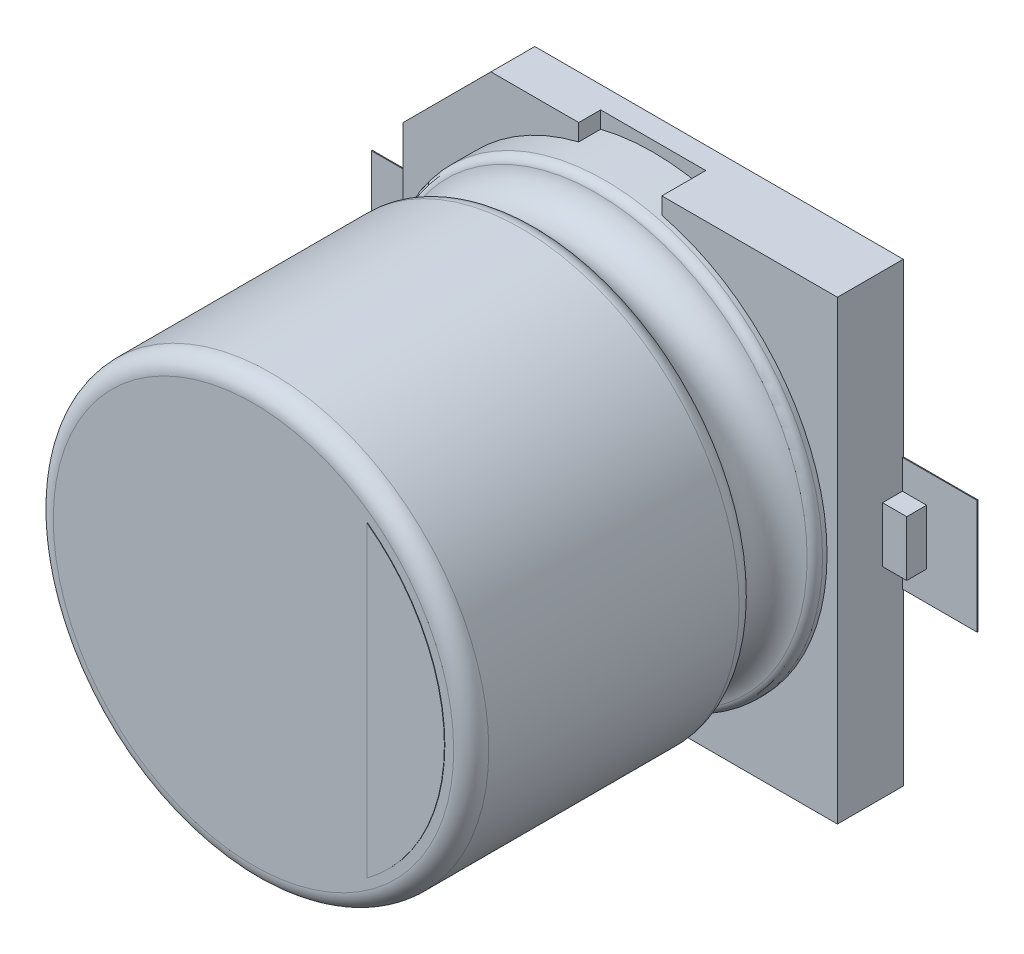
ISO-10303-21;
HEADER;
FILE_DESCRIPTION(('STEP AP214'),'2;1');
FILE_NAME('part.step','',(''),(''),'','','');
FILE_SCHEMA(('AUTOMOTIVE_DESIGN { 1 0 10303 214 1 1 1 1 }'));
ENDSEC;
DATA;
#1=APPLICATION_CONTEXT('core data for automotive mechanical design processes');
#2=APPLICATION_PROTOCOL_DEFINITION('international standard','automotive_design',2000,#1);
#3=PRODUCT_CONTEXT('',#1,'mechanical');
#4=PRODUCT('Part','Part','',(#3));
#5=PRODUCT_RELATED_PRODUCT_CATEGORY('part','',(#4));
#6=PRODUCT_DEFINITION_FORMATION('','',#4);
#7=PRODUCT_DEFINITION_CONTEXT('part definition',#1,'design');
#8=PRODUCT_DEFINITION('design','',#6,#7);
#9=PRODUCT_DEFINITION_SHAPE('','',#8);
#10=(LENGTH_UNIT() NAMED_UNIT(*) SI_UNIT(.MILLI.,.METRE.));
#11=(NAMED_UNIT(*) PLANE_ANGLE_UNIT() SI_UNIT($,.RADIAN.));
#12=(NAMED_UNIT(*) SI_UNIT($,.STERADIAN.) SOLID_ANGLE_UNIT());
#13=UNCERTAINTY_MEASURE_WITH_UNIT(LENGTH_MEASURE(1.E-05),#10,'distance_accuracy_value','');
#14=(GEOMETRIC_REPRESENTATION_CONTEXT(3) GLOBAL_UNCERTAINTY_ASSIGNED_CONTEXT((#13)) GLOBAL_UNIT_ASSIGNED_CONTEXT((#10,
#11,#12)) REPRESENTATION_CONTEXT('',''));
#15=CARTESIAN_POINT('',(0.,0.,0.));
#16=DIRECTION('',(0.,0.,1.));
#17=DIRECTION('',(1.,0.,0.));
#18=AXIS2_PLACEMENT_3D('',#15,#16,#17);
#19=CARTESIAN_POINT('',(0.,0.,6.182614));
#20=DIRECTION('',(0.,0.,1.));
#21=DIRECTION('',(1.,0.,0.));
#22=AXIS2_PLACEMENT_3D('',#19,#20,#21);
#23=PLANE('',#22);
#24=CARTESIAN_POINT('',(0.,0.,6.182614));
#25=DIRECTION('',(0.,0.,1.));
#26=DIRECTION('',(1.,0.,0.));
#27=AXIS2_PLACEMENT_3D('',#24,#25,#26);
#28=CIRCLE('',#27,2.7686291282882);
#29=CARTESIAN_POINT('',(1.651,2.22250000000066,6.182614));
#30=VERTEX_POINT('',#29);
#31=CARTESIAN_POINT('',(1.651,-2.22250000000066,6.182614));
#32=VERTEX_POINT('',#31);
#33=EDGE_CURVE('E235',#30,#32,#28,.F.);
#34=ORIENTED_EDGE('',*,*,#33,.F.);
#35=DIRECTION('',(0.,1.,0.));
#36=VECTOR('',#35,1.);
#37=CARTESIAN_POINT('',(1.651,2.2225,6.182614));
#38=LINE('',#37,#36);
#39=EDGE_CURVE('E229',#32,#30,#38,.T.);
#40=ORIENTED_EDGE('',*,*,#39,.F.);
#41=EDGE_LOOP('',(#34,#40));
#42=FACE_BOUND('',#41,.T.);
#43=ADVANCED_FACE('F16',(#42),#23,.T.);
#44=CARTESIAN_POINT('',(0.,0.,6.176264));
#45=DIRECTION('',(0.,0.,1.));
#46=DIRECTION('',(1.,0.,0.));
#47=AXIS2_PLACEMENT_3D('',#44,#45,#46);
#48=CYLINDRICAL_SURFACE('',#47,2.7686291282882);
#49=DIRECTION('',(0.,0.,1.));
#50=VECTOR('',#49,1.);
#51=CARTESIAN_POINT('',(1.651,-2.2225,6.176264));
#52=LINE('',#51,#50);
#53=CARTESIAN_POINT('',(1.651,-2.22250000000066,6.176264));
#54=VERTEX_POINT('',#53);
#55=EDGE_CURVE('E238',#54,#32,#52,.T.);
#56=ORIENTED_EDGE('',*,*,#55,.F.);
#57=CARTESIAN_POINT('',(0.,0.,6.176264));
#58=DIRECTION('',(0.,0.,1.));
#59=DIRECTION('',(1.,0.,0.));
#60=AXIS2_PLACEMENT_3D('',#57,#58,#59);
#61=CIRCLE('',#60,2.7686291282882);
#62=CARTESIAN_POINT('',(1.651,2.22250000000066,6.176264));
#63=VERTEX_POINT('',#62);
#64=EDGE_CURVE('E248',#63,#54,#61,.F.);
#65=ORIENTED_EDGE('',*,*,#64,.F.);
#66=DIRECTION('',(0.,0.,1.));
#67=VECTOR('',#66,1.);
#68=CARTESIAN_POINT('',(1.651,2.2225,6.176264));
#69=LINE('',#68,#67);
#70=EDGE_CURVE('E240',#30,#63,#69,.F.);
#71=ORIENTED_EDGE('',*,*,#70,.F.);
#72=ORIENTED_EDGE('',*,*,#33,.T.);
#73=EDGE_LOOP('',(#56,#65,#71,#72));
#74=FACE_BOUND('',#73,.T.);
#75=ADVANCED_FACE('F236',(#74),#48,.T.);
#76=CARTESIAN_POINT('',(1.651,2.2225,6.176264));
#77=DIRECTION('',(-1.,0.,0.));
#78=DIRECTION('',(0.,0.,1.));
#79=AXIS2_PLACEMENT_3D('',#76,#77,#78);
#80=PLANE('',#79);
#81=ORIENTED_EDGE('',*,*,#70,.T.);
#82=DIRECTION('',(0.,1.,0.));
#83=VECTOR('',#82,1.);
#84=CARTESIAN_POINT('',(1.651,0.,6.176264));
#85=LINE('',#84,#83);
#86=EDGE_CURVE('E245',#54,#63,#85,.T.);
#87=ORIENTED_EDGE('',*,*,#86,.F.);
#88=ORIENTED_EDGE('',*,*,#55,.T.);
#89=ORIENTED_EDGE('',*,*,#39,.T.);
#90=EDGE_LOOP('',(#81,#87,#88,#89));
#91=FACE_BOUND('',#90,.T.);
#92=ADVANCED_FACE('F243',(#91),#80,.T.);
#93=CARTESIAN_POINT('',(0.,0.,6.176264));
#94=DIRECTION('',(0.,0.,1.));
#95=DIRECTION('',(1.,0.,0.));
#96=AXIS2_PLACEMENT_3D('',#93,#94,#95);
#97=PLANE('',#96);
#98=ORIENTED_EDGE('',*,*,#64,.T.);
#99=ORIENTED_EDGE('',*,*,#86,.T.);
#100=EDGE_LOOP('',(#98,#99));
#101=FACE_BOUND('',#100,.T.);
#102=CARTESIAN_POINT('',(2.89599998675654,0.,6.176264));
#103=CARTESIAN_POINT('',(2.89600001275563,-0.00295847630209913,6.17626399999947));
#104=CARTESIAN_POINT('',(2.89599562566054,-0.00591696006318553,6.17626400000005));
#105=CARTESIAN_POINT('',(2.89598243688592,-0.0103730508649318,6.17626399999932));
#106=CARTESIAN_POINT('',(2.89597688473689,-0.0118706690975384,6.1762639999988));
#107=CARTESIAN_POINT('',(2.89596349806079,-0.0148781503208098,6.17626399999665));
#108=CARTESIAN_POINT('',(2.89595564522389,-0.0163880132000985,6.17626399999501));
#109=CARTESIAN_POINT('',(2.89566773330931,-0.0645122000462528,6.17626399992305));
#110=CARTESIAN_POINT('',(2.89426393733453,-0.111127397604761,6.17626399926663));
#111=CARTESIAN_POINT('',(2.88920686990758,-0.204232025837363,6.17626399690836));
#112=CARTESIAN_POINT('',(2.88555357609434,-0.250721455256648,6.17626399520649));
#113=CARTESIAN_POINT('',(2.87600677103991,-0.343471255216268,6.17626399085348));
#114=CARTESIAN_POINT('',(2.87011323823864,-0.389731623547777,6.17626398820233));
#115=CARTESIAN_POINT('',(2.85609945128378,-0.481914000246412,6.17626398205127));
#116=CARTESIAN_POINT('',(2.84797917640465,-0.527836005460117,6.17626397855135));
#117=CARTESIAN_POINT('',(2.82953086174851,-0.619234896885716,6.17626397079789));
#118=CARTESIAN_POINT('',(2.81920280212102,-0.664711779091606,6.17626396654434));
#119=CARTESIAN_POINT('',(2.79636295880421,-0.755114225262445,6.17626395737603));
#120=CARTESIAN_POINT('',(2.78385115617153,-0.800039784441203,6.17626395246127));
#121=CARTESIAN_POINT('',(2.75667296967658,-0.889234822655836,6.17626394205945));
#122=CARTESIAN_POINT('',(2.74200656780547,-0.933504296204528,6.17626393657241));
#123=CARTESIAN_POINT('',(2.71055339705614,-1.0212837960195,6.17626392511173));
#124=CARTESIAN_POINT('',(2.69376661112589,-1.06479381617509,6.1762639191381));
#125=CARTESIAN_POINT('',(2.65781749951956,-1.15166401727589,6.17626390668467));
#126=CARTESIAN_POINT('',(2.63862053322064,-1.1950098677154,6.17626390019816));
#127=CARTESIAN_POINT('',(2.59812231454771,-1.28070745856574,6.17626388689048));
#128=CARTESIAN_POINT('',(2.57682104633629,-1.32305919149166,6.17626388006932));
#129=CARTESIAN_POINT('',(2.53216550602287,-1.40666653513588,6.17626386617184));
#130=CARTESIAN_POINT('',(2.50881121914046,-1.44792213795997,6.17626385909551));
#131=CARTESIAN_POINT('',(2.46010591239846,-1.52923774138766,6.17626384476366));
#132=CARTESIAN_POINT('',(2.43475487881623,-1.56929773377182,6.17626383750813));
#133=CARTESIAN_POINT('',(2.38211715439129,-1.6481255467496,6.1762638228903));
#134=CARTESIAN_POINT('',(2.35483045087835,-1.6868933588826,6.176263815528));
#135=CARTESIAN_POINT('',(2.29838713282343,-1.76304334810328,6.17626380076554));
#136=CARTESIAN_POINT('',(2.2692305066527,-1.80042551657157,6.17626379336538));
#137=CARTESIAN_POINT('',(2.20911759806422,-1.87371409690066,6.17626377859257));
#138=CARTESIAN_POINT('',(2.17816130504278,-1.90962050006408,6.17626377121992));
#139=CARTESIAN_POINT('',(2.11452365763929,-1.97987098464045,6.17626375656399));
#140=CARTESIAN_POINT('',(2.08184229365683,-2.0142150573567,6.17626374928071));
#141=CARTESIAN_POINT('',(2.01483325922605,-2.08125808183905,6.17626373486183));
#142=CARTESIAN_POINT('',(1.98050558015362,-2.11395702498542,6.17626372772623));
#143=CARTESIAN_POINT('',(1.91028664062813,-2.17763095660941,6.17626371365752));
#144=CARTESIAN_POINT('',(1.87439537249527,-2.20860593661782,6.17626370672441));
#145=CARTESIAN_POINT('',(1.80113575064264,-2.26875726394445,6.17626369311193));
#146=CARTESIAN_POINT('',(1.76376739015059,-2.29793360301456,6.17626368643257));
#147=CARTESIAN_POINT('',(1.68764364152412,-2.35441730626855,6.17626367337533));
#148=CARTESIAN_POINT('',(1.64888824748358,-2.38172466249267,6.17626366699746));
#149=CARTESIAN_POINT('',(1.57008383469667,-2.43440456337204,6.17626365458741));
#150=CARTESIAN_POINT('',(1.5300348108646,-2.45977710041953,6.17626364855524));
#151=CARTESIAN_POINT('',(1.44873966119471,-2.50852619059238,6.17626363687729));
#152=CARTESIAN_POINT('',(1.40749353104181,-2.5319027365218,6.1762636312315));
#153=CARTESIAN_POINT('',(1.32390357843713,-2.57660348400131,6.17626362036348));
#154=CARTESIAN_POINT('',(1.28155975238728,-2.59792767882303,6.17626361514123));
#155=CARTESIAN_POINT('',(1.19587646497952,-2.63847231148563,6.17626360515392));
#156=CARTESIAN_POINT('',(1.15253700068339,-2.65769274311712,6.17626360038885));
#157=CARTESIAN_POINT('',(1.06496689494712,-2.69398350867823,6.17626359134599));
#158=CARTESIAN_POINT('',(1.02073625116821,-2.71105383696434,6.17626358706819));
#159=CARTESIAN_POINT('',(0.931490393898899,-2.74300323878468,6.17626357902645));
#160=CARTESIAN_POINT('',(0.886475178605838,-2.75788230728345,6.1762635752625));
#161=CARTESIAN_POINT('',(0.795768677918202,-2.78541331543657,6.1762635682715));
#162=CARTESIAN_POINT('',(0.750077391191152,-2.79806525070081,6.17626356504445));
#163=CARTESIAN_POINT('',(0.658128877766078,-2.82111148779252,6.17626355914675));
#164=CARTESIAN_POINT('',(0.611871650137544,-2.83150578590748,6.17626355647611));
#165=CARTESIAN_POINT('',(0.518902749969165,-2.85001168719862,6.17626355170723));
#166=CARTESIAN_POINT('',(0.472191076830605,-2.85812328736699,6.176263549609));
#167=CARTESIAN_POINT('',(0.37842587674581,-2.87204423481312,6.17626354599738));
#168=CARTESIAN_POINT('',(0.331372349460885,-2.87785357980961,6.17626354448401));
#169=CARTESIAN_POINT('',(0.237036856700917,-2.88715600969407,6.17626354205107));
#170=CARTESIAN_POINT('',(0.189754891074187,-2.89064909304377,6.1762635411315));
#171=CARTESIAN_POINT('',(0.0950764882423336,-2.89531057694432,6.17626353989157));
#172=CARTESIAN_POINT('',(0.0476800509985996,-2.89647897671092,6.17626353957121));
#173=CARTESIAN_POINT('',(-0.0471130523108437,-2.8964882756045,6.17626353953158));
#174=CARTESIAN_POINT('',(-0.0945097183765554,-2.89532917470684,6.17626353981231));
#175=CARTESIAN_POINT('',(-0.189189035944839,-2.89068626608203,6.17626354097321));
#176=CARTESIAN_POINT('',(-0.236471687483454,-2.88720245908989,6.17626354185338));
#177=CARTESIAN_POINT('',(-0.330809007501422,-2.87791853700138,6.17626354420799));
#178=CARTESIAN_POINT('',(-0.377863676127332,-2.87211842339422,6.17626354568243));
#179=CARTESIAN_POINT('',(-0.471631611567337,-2.8582158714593,6.17626354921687));
#180=CARTESIAN_POINT('',(-0.518344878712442,-2.85011343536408,6.17626355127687));
#181=CARTESIAN_POINT('',(-0.6113174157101,-2.83162577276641,6.17626355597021));
#182=CARTESIAN_POINT('',(-0.65757668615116,-2.8212405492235,6.17626355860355));
#183=CARTESIAN_POINT('',(-0.749529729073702,-2.79821234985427,6.1762635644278));
#184=CARTESIAN_POINT('',(-0.795223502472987,-2.7855693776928,6.17626356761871));
#185=CARTESIAN_POINT('',(-0.885935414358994,-2.75805616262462,6.17626357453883));
#186=CARTESIAN_POINT('',(-0.930953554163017,-2.7431859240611,6.17626357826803));
#187=CARTESIAN_POINT('',(-1.02020569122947,-2.71125402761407,6.17626358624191));
#188=CARTESIAN_POINT('',(-1.06443969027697,-2.69419237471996,6.17626359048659));
#189=CARTESIAN_POINT('',(-1.1520169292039,-2.6579187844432,6.17626359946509));
#190=CARTESIAN_POINT('',(-1.19536017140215,-2.63870685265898,6.1762636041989));
#191=CARTESIAN_POINT('',(-1.28105142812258,-2.59817902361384,6.1762636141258));
#192=CARTESIAN_POINT('',(-1.3233994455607,-2.57686313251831,6.17626361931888));
#193=CARTESIAN_POINT('',(-1.40699818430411,-2.53217877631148,6.17626363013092));
#194=CARTESIAN_POINT('',(-1.4482489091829,-2.50881031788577,6.17626363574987));
#195=CARTESIAN_POINT('',(-1.52955364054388,-2.46007716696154,6.17626364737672));
#196=CARTESIAN_POINT('',(-1.56960765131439,-2.43471248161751,6.17626365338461));
#197=CARTESIAN_POINT('',(-1.64842241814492,-2.38204802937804,6.17626366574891));
#198=CARTESIAN_POINT('',(-1.68718317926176,-2.35474827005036,6.1762636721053));
#199=CARTESIAN_POINT('',(-1.7633180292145,-2.29827948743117,6.1762636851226));
#200=CARTESIAN_POINT('',(-1.80069212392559,-2.26911047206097,6.17626369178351));
#201=CARTESIAN_POINT('',(-1.87396356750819,-2.20897350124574,6.17626370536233));
#202=CARTESIAN_POINT('',(-1.90986092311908,-2.17800555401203,6.17626371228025));
#203=CARTESIAN_POINT('',(-1.98009237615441,-2.11434538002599,6.17626372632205));
#204=CARTESIAN_POINT('',(-2.01442648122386,-2.08165316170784,6.17626373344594));
#205=CARTESIAN_POINT('',(-2.08144869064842,-2.01462326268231,6.17626374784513));
#206=CARTESIAN_POINT('',(-2.11413680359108,-1.98028559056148,6.17626375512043));
#207=CARTESIAN_POINT('',(-2.17778825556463,-1.91004756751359,6.17626376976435));
#208=CARTESIAN_POINT('',(-2.20875160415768,-1.874147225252,6.17626377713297));
#209=CARTESIAN_POINT('',(-2.26887891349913,-1.80087041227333,6.17626379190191));
#210=CARTESIAN_POINT('',(-2.29804288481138,-1.76349395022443,6.17626379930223));
#211=CARTESIAN_POINT('',(-2.35450116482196,-1.68735500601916,6.17626381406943));
#212=CARTESIAN_POINT('',(-2.38179548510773,-1.64859253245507,6.17626382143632));
#213=CARTESIAN_POINT('',(-2.43444869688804,-1.56977501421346,6.17626383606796));
#214=CARTESIAN_POINT('',(-2.45980760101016,-1.52971997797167,6.17626384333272));
#215=CARTESIAN_POINT('',(-2.50852888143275,-1.44841389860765,6.17626385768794));
#216=CARTESIAN_POINT('',(-2.53189127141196,-1.40716286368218,6.17626386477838));
#217=CARTESIAN_POINT('',(-2.57656323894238,-1.32356423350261,6.17626387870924));
#218=CARTESIAN_POINT('',(-2.59787283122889,-1.2812166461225,6.17626388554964));
#219=CARTESIAN_POINT('',(-2.638387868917,-1.19552700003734,6.17626389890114));
#220=CARTESIAN_POINT('',(-2.65759333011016,-1.15218494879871,6.17626390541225));
#221=CARTESIAN_POINT('',(-2.6938538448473,-1.0646108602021,6.17626391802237));
#222=CARTESIAN_POINT('',(-2.71090891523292,-1.02037882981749,6.17626392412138));
#223=CARTESIAN_POINT('',(-2.74282757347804,-0.93113141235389,6.17626393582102));
#224=CARTESIAN_POINT('',(-2.75769117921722,-0.886116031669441,6.17626394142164));
#225=CARTESIAN_POINT('',(-2.78519111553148,-0.795410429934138,6.17626395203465));
#226=CARTESIAN_POINT('',(-2.79782746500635,-0.749720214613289,6.17626395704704));
#227=CARTESIAN_POINT('',(-2.82084247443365,-0.657775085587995,6.1762639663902));
#228=CARTESIAN_POINT('',(-2.83122115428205,-0.61152017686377,6.17626397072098));
#229=CARTESIAN_POINT('',(-2.849695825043,-0.518557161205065,6.17626397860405));
#230=CARTESIAN_POINT('',(-2.85779183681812,-0.471849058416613,6.17626398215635));
#231=CARTESIAN_POINT('',(-2.8716817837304,-0.378092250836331,6.17626398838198));
#232=CARTESIAN_POINT('',(-2.87747574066,-0.331043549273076,6.17626399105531));
#233=CARTESIAN_POINT('',(-2.88674733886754,-0.236718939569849,6.17626399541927));
#234=CARTESIAN_POINT('',(-2.89022500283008,-0.189443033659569,6.17626399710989));
#235=CARTESIAN_POINT('',(-2.89485686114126,-0.0947780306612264,6.1762639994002));
#236=CARTESIAN_POINT('',(-2.89601107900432,-0.0473889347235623,6.17626399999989));
#237=CARTESIAN_POINT('',(-2.89599998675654,0.,6.176264));
#238=B_SPLINE_CURVE_WITH_KNOTS('',3,(#102,#103,#104,#105,#106,#107,#108,#109,#110,#111,#112,
#113,#114,#115,#116,#117,#118,#119,#120,#121,#122,#123,#124,#125,#126,#127,#128,#129,#130,#131,
#132,#133,#134,#135,#136,#137,#138,#139,#140,#141,#142,#143,#144,#145,#146,#147,#148,#149,#150,
#151,#152,#153,#154,#155,#156,#157,#158,#159,#160,#161,#162,#163,#164,#165,#166,#167,#168,#169,
#170,#171,#172,#173,#174,#175,#176,#177,#178,#179,#180,#181,#182,#183,#184,#185,#186,#187,#188,
#189,#190,#191,#192,#193,#194,#195,#196,#197,#198,#199,#200,#201,#202,#203,#204,#205,#206,#207,
#208,#209,#210,#211,#212,#213,#214,#215,#216,#217,#218,#219,#220,#221,#222,#223,#224,#225,#226,
#227,#228,#229,#230,#231,#232,#233,#234,#235,#236,#237),.UNSPECIFIED.,.F.,.F.,(4,2,2,2,2,2,2,2,
2,2,2,2,2,2,2,2,2,2,2,2,2,2,2,2,2,2,2,2,2,2,2,2,2,2,2,2,2,2,2,2,2,2,2,2,2,2,2,2,2,2,2,2,2,2,2,2,
2,2,2,2,2,2,2,2,2,2,2,4),(0.,0.00887543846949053,0.0133683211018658,0.0178979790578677,
0.157743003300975,0.297589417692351,0.437437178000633,0.577286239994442,0.717136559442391,
0.856988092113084,0.996840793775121,1.1366946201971,1.27885714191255,1.42102073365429,
1.56318534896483,1.70535094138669,1.84751746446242,1.98968487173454,2.13185311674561,
2.27402215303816,2.41619193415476,2.55836241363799,2.70053354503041,2.84270528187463,
2.98487757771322,3.12705038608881,3.26922366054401,3.41139735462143,3.55357142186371,
3.69574581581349,3.83792049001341,3.98009539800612,4.12227049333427,4.26444572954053,
4.40662106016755,4.548796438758,4.69097181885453,4.83314715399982,4.97532239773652,
5.11749750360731,5.25967242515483,5.40184711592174,5.54402152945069,5.68619561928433,
5.8283693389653,5.97054264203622,6.11271548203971,6.25488781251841,6.3970595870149,
6.5392307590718,6.68140128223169,6.82357111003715,6.96574019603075,7.10790849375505,
7.25007595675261,7.39224253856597,7.53440819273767,7.67657287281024,7.81873653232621,
7.9608991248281,8.10306060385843,8.24522092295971,8.38738003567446,8.52953789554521,
8.67169445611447,8.8138496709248,8.95600349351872,9.0981558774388),.UNSPECIFIED.);
#239=CARTESIAN_POINT('',(2.89599998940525,0.,6.176264));
#240=VERTEX_POINT('',#239);
#241=CARTESIAN_POINT('',(-2.89599998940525,0.,6.176264));
#242=VERTEX_POINT('',#241);
#243=EDGE_CURVE('E269',#240,#242,#238,.T.);
#244=ORIENTED_EDGE('',*,*,#243,.F.);
#245=CARTESIAN_POINT('',(0.,0.,6.176264));
#246=DIRECTION('',(0.,0.,-1.));
#247=DIRECTION('',(-1.,0.,0.));
#248=AXIS2_PLACEMENT_3D('',#245,#246,#247);
#249=CIRCLE('',#248,2.89599999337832);
#250=EDGE_CURVE('E272',#242,#240,#249,.T.);
#251=ORIENTED_EDGE('',*,*,#250,.F.);
#252=EDGE_LOOP('',(#244,#251));
#253=FACE_BOUND('',#252,.T.);
#254=ADVANCED_FACE('F277',(#101,#253),#97,.T.);
#255=CARTESIAN_POINT('',(0.,0.,5.922264));
#256=DIRECTION('',(0.,0.,1.));
#257=DIRECTION('',(0.99998090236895,-0.00618020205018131,0.));
#258=AXIS2_PLACEMENT_3D('',#255,#256,#257);
#259=TOROIDAL_SURFACE('',#258,2.8960000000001,0.254);
#260=CARTESIAN_POINT('',(0.,0.,5.922264));
#261=DIRECTION('',(0.,0.,1.));
#262=DIRECTION('',(1.,0.,0.));
#263=AXIS2_PLACEMENT_3D('',#260,#261,#262);
#264=CIRCLE('',#263,3.1500000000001);
#265=CARTESIAN_POINT('',(3.1500000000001,0.,5.922264));
#266=VERTEX_POINT('',#265);
#267=EDGE_CURVE('E278',#266,#266,#264,.F.);
#268=ORIENTED_EDGE('',*,*,#267,.F.);
#269=EDGE_LOOP('',(#268));
#270=FACE_BOUND('',#269,.T.);
#271=ORIENTED_EDGE('',*,*,#250,.T.);
#272=ORIENTED_EDGE('',*,*,#243,.T.);
#273=EDGE_LOOP('',(#271,#272));
#274=FACE_BOUND('',#273,.T.);
#275=ADVANCED_FACE('F271',(#270,#274),#259,.T.);
#276=CARTESIAN_POINT('',(0.,0.,0.0762));
#277=DIRECTION('',(0.,0.,1.));
#278=DIRECTION('',(1.,0.,0.));
#279=AXIS2_PLACEMENT_3D('',#276,#277,#278);
#280=CYLINDRICAL_SURFACE('',#279,3.1500000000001);
#281=CARTESIAN_POINT('',(0.,0.,2.30168137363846));
#282=DIRECTION('',(0.,0.,1.));
#283=DIRECTION('',(0.999979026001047,-0.0064766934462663,0.));
#284=AXIS2_PLACEMENT_3D('',#281,#282,#283);
#285=CIRCLE('',#284,3.1500000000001);
#286=CARTESIAN_POINT('',(3.1499339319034,-0.0204015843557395,2.30168137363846));
#287=VERTEX_POINT('',#286);
#288=EDGE_CURVE('E469',#287,#287,#285,.F.);
#289=ORIENTED_EDGE('',*,*,#288,.F.);
#290=EDGE_LOOP('',(#289));
#291=FACE_BOUND('',#290,.T.);
#292=ORIENTED_EDGE('',*,*,#267,.T.);
#293=EDGE_LOOP('',(#292));
#294=FACE_BOUND('',#293,.T.);
#295=ADVANCED_FACE('F465',(#291,#294),#280,.T.);
#296=CARTESIAN_POINT('',(0.,0.,2.30168137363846));
#297=DIRECTION('',(0.,0.,1.));
#298=DIRECTION('',(0.999979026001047,-0.00647669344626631,0.));
#299=AXIS2_PLACEMENT_3D('',#296,#297,#298);
#300=TOROIDAL_SURFACE('',#299,2.8960000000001,0.254);
#301=CARTESIAN_POINT('',(0.,0.,2.06506997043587));
#302=DIRECTION('',(0.,0.,-1.));
#303=DIRECTION('',(0.,-1.,0.));
#304=AXIS2_PLACEMENT_3D('',#301,#302,#303);
#305=CIRCLE('',#304,2.98836365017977);
#306=CARTESIAN_POINT('',(0.,-2.98836365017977,2.06506997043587));
#307=VERTEX_POINT('',#306);
#308=EDGE_CURVE('E455',#307,#307,#305,.F.);
#309=ORIENTED_EDGE('',*,*,#308,.T.);
#310=EDGE_LOOP('',(#309));
#311=FACE_BOUND('',#310,.T.);
#312=ORIENTED_EDGE('',*,*,#288,.T.);
#313=EDGE_LOOP('',(#312));
#314=FACE_BOUND('',#313,.T.);
#315=ADVANCED_FACE('F462',(#311,#314),#300,.T.);
#316=CARTESIAN_POINT('',(0.,0.,1.651));
#317=DIRECTION('',(0.,0.,-1.));
#318=DIRECTION('',(0.,-1.,0.));
#319=AXIS2_PLACEMENT_3D('',#316,#317,#318);
#320=TOROIDAL_SURFACE('',#319,3.1500000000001,0.4445);
#321=ORIENTED_EDGE('',*,*,#308,.F.);
#322=EDGE_LOOP('',(#321));
#323=FACE_BOUND('',#322,.T.);
#324=CARTESIAN_POINT('',(0.,0.,1.21761425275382));
#325=DIRECTION('',(0.,0.,1.));
#326=DIRECTION('',(-0.999982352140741,-0.00594099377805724,0.));
#327=AXIS2_PLACEMENT_3D('',#324,#325,#326);
#328=CIRCLE('',#327,3.05122224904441);
#329=CARTESIAN_POINT('',(-3.0511684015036,-0.0181272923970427,1.21761425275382));
#330=VERTEX_POINT('',#329);
#331=EDGE_CURVE('E451',#330,#330,#328,.F.);
#332=ORIENTED_EDGE('',*,*,#331,.F.);
#333=EDGE_LOOP('',(#332));
#334=FACE_BOUND('',#333,.T.);
#335=ADVANCED_FACE('F459',(#323,#334),#320,.F.);
#336=CARTESIAN_POINT('',(0.,0.,0.37620000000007));
#337=DIRECTION('',(0.,0.,1.));
#338=DIRECTION('',(1.,0.,0.));
#339=AXIS2_PLACEMENT_3D('',#336,#337,#338);
#340=PLANE('',#339);
#341=DIRECTION('',(1.,0.,0.));
#342=VECTOR('',#341,1.);
#343=CARTESIAN_POINT('',(-3.65000000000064,-0.399999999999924,0.37620000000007));
#344=LINE('',#343,#342);
#345=CARTESIAN_POINT('',(-3.2999999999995,-0.399999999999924,0.37620000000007));
#346=VERTEX_POINT('',#345);
#347=CARTESIAN_POINT('',(-3.65000000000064,-0.399999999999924,0.37620000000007));
#348=VERTEX_POINT('',#347);
#349=EDGE_CURVE('E454',#346,#348,#344,.F.);
#350=ORIENTED_EDGE('',*,*,#349,.F.);
#351=DIRECTION('',(0.,1.,0.));
#352=VECTOR('',#351,1.);
#353=CARTESIAN_POINT('',(-3.2999999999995,2.03000000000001,0.37620000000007));
#354=LINE('',#353,#352);
#355=CARTESIAN_POINT('',(-3.2999999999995,0.399999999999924,0.37620000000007));
#356=VERTEX_POINT('',#355);
#357=EDGE_CURVE('E818',#356,#346,#354,.F.);
#358=ORIENTED_EDGE('',*,*,#357,.F.);
#359=DIRECTION('',(1.,0.,0.));
#360=VECTOR('',#359,1.);
#361=CARTESIAN_POINT('',(-1.05000000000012,0.399999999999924,0.37620000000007));
#362=LINE('',#361,#360);
#363=CARTESIAN_POINT('',(-3.65000000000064,0.399999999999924,0.37620000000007));
#364=VERTEX_POINT('',#363);
#365=EDGE_CURVE('E839',#364,#356,#362,.T.);
#366=ORIENTED_EDGE('',*,*,#365,.F.);
#367=DIRECTION('',(0.,1.,0.));
#368=VECTOR('',#367,1.);
#369=CARTESIAN_POINT('',(-3.65000000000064,0.399999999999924,0.37620000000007));
#370=LINE('',#369,#368);
#371=EDGE_CURVE('E819',#348,#364,#370,.T.);
#372=ORIENTED_EDGE('',*,*,#371,.F.);
#373=EDGE_LOOP('',(#350,#358,#366,#372));
#374=FACE_BOUND('',#373,.T.);
#375=ADVANCED_FACE('F437',(#374),#340,.T.);
#376=CARTESIAN_POINT('',(0.,0.,1.09378976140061));
#377=DIRECTION('',(0.,0.,1.));
#378=DIRECTION('',(-0.999982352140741,-0.00594099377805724,0.));
#379=AXIS2_PLACEMENT_3D('',#376,#377,#378);
#380=TOROIDAL_SURFACE('',#379,3.0230000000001,0.127);
#381=ORIENTED_EDGE('',*,*,#331,.T.);
#382=EDGE_LOOP('',(#381));
#383=FACE_BOUND('',#382,.T.);
#384=CARTESIAN_POINT('',(0.,0.,1.09378976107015));
#385=DIRECTION('',(0.,0.,1.));
#386=DIRECTION('',(1.,0.,0.));
#387=AXIS2_PLACEMENT_3D('',#384,#385,#386);
#388=CIRCLE('',#387,3.1500000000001);
#389=CARTESIAN_POINT('',(3.1500000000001,0.,1.09378976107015));
#390=VERTEX_POINT('',#389);
#391=EDGE_CURVE('E445',#390,#390,#388,.F.);
#392=ORIENTED_EDGE('',*,*,#391,.F.);
#393=EDGE_LOOP('',(#392));
#394=FACE_BOUND('',#393,.T.);
#395=ADVANCED_FACE('F432',(#383,#394),#380,.T.);
#396=CARTESIAN_POINT('',(3.65000000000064,-0.399999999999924,0.0762));
#397=DIRECTION('',(1.,0.,0.));
#398=DIRECTION('',(0.,0.,-1.));
#399=AXIS2_PLACEMENT_3D('',#396,#397,#398);
#400=PLANE('',#399);
#401=DIRECTION('',(0.,0.,-1.));
#402=VECTOR('',#401,1.);
#403=CARTESIAN_POINT('',(3.65000000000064,-0.399999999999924,0.0762));
#404=LINE('',#403,#402);
#405=CARTESIAN_POINT('',(3.65000000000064,-0.399999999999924,0.0889));
#406=VERTEX_POINT('',#405);
#407=CARTESIAN_POINT('',(3.65000000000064,-0.399999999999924,0.37620000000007));
#408=VERTEX_POINT('',#407);
#409=EDGE_CURVE('E950',#406,#408,#404,.F.);
#410=ORIENTED_EDGE('',*,*,#409,.F.);
#411=DIRECTION('',(0.,1.,0.));
#412=VECTOR('',#411,1.);
#413=CARTESIAN_POINT('',(3.65000000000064,0.,0.0889));
#414=LINE('',#413,#412);
#415=CARTESIAN_POINT('',(3.65000000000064,0.399999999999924,0.0889));
#416=VERTEX_POINT('',#415);
#417=EDGE_CURVE('E448',#416,#406,#414,.F.);
#418=ORIENTED_EDGE('',*,*,#417,.F.);
#419=DIRECTION('',(0.,0.,1.));
#420=VECTOR('',#419,1.);
#421=CARTESIAN_POINT('',(3.65000000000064,0.399999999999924,0.0762));
#422=LINE('',#421,#420);
#423=CARTESIAN_POINT('',(3.65000000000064,0.399999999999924,0.37620000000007));
#424=VERTEX_POINT('',#423);
#425=EDGE_CURVE('E937',#424,#416,#422,.F.);
#426=ORIENTED_EDGE('',*,*,#425,.F.);
#427=DIRECTION('',(0.,1.,0.));
#428=VECTOR('',#427,1.);
#429=CARTESIAN_POINT('',(3.65000000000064,0.,0.37620000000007));
#430=LINE('',#429,#428);
#431=EDGE_CURVE('E942',#408,#424,#430,.T.);
#432=ORIENTED_EDGE('',*,*,#431,.F.);
#433=EDGE_LOOP('',(#410,#418,#426,#432));
#434=FACE_BOUND('',#433,.T.);
#435=ADVANCED_FACE('F428',(#434),#400,.T.);
#436=CARTESIAN_POINT('',(-3.65000000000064,-0.399999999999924,0.0762));
#437=DIRECTION('',(0.,-1.,0.));
#438=DIRECTION('',(0.,0.,-1.));
#439=AXIS2_PLACEMENT_3D('',#436,#437,#438);
#440=PLANE('',#439);
#441=DIRECTION('',(0.,0.,1.));
#442=VECTOR('',#441,1.);
#443=CARTESIAN_POINT('',(-3.65000000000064,-0.399999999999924,0.0762));
#444=LINE('',#443,#442);
#445=CARTESIAN_POINT('',(-3.65000000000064,-0.399999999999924,0.0889));
#446=VERTEX_POINT('',#445);
#447=EDGE_CURVE('E822',#446,#348,#444,.T.);
#448=ORIENTED_EDGE('',*,*,#447,.F.);
#449=DIRECTION('',(1.,0.,0.));
#450=VECTOR('',#449,1.);
#451=CARTESIAN_POINT('',(0.,-0.399999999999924,0.0889));
#452=LINE('',#451,#450);
#453=CARTESIAN_POINT('',(-3.2999999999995,-0.399999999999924,0.0889));
#454=VERTEX_POINT('',#453);
#455=EDGE_CURVE('E826',#454,#446,#452,.F.);
#456=ORIENTED_EDGE('',*,*,#455,.F.);
#457=DIRECTION('',(0.,0.,1.));
#458=VECTOR('',#457,1.);
#459=CARTESIAN_POINT('',(-3.2999999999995,-0.399999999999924,0.0762));
#460=LINE('',#459,#458);
#461=EDGE_CURVE('E825',#346,#454,#460,.F.);
#462=ORIENTED_EDGE('',*,*,#461,.F.);
#463=ORIENTED_EDGE('',*,*,#349,.T.);
#464=EDGE_LOOP('',(#448,#456,#462,#463));
#465=FACE_BOUND('',#464,.T.);
#466=ADVANCED_FACE('F424',(#465),#440,.T.);
#467=CARTESIAN_POINT('',(-3.65000000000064,0.399999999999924,0.0762));
#468=DIRECTION('',(-1.,0.,0.));
#469=DIRECTION('',(0.,0.,1.));
#470=AXIS2_PLACEMENT_3D('',#467,#468,#469);
#471=PLANE('',#470);
#472=DIRECTION('',(0.,0.,1.));
#473=VECTOR('',#472,1.);
#474=CARTESIAN_POINT('',(-3.65000000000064,0.399999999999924,0.0762));
#475=LINE('',#474,#473);
#476=CARTESIAN_POINT('',(-3.65000000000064,0.399999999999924,0.0889));
#477=VERTEX_POINT('',#476);
#478=EDGE_CURVE('E854',#477,#364,#475,.T.);
#479=ORIENTED_EDGE('',*,*,#478,.F.);
#480=DIRECTION('',(0.,1.,0.));
#481=VECTOR('',#480,1.);
#482=CARTESIAN_POINT('',(-3.65000000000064,0.,0.0889));
#483=LINE('',#482,#481);
#484=EDGE_CURVE('E921',#446,#477,#483,.T.);
#485=ORIENTED_EDGE('',*,*,#484,.F.);
#486=ORIENTED_EDGE('',*,*,#447,.T.);
#487=ORIENTED_EDGE('',*,*,#371,.T.);
#488=EDGE_LOOP('',(#479,#485,#486,#487));
#489=FACE_BOUND('',#488,.T.);
#490=ADVANCED_FACE('F420',(#489),#471,.T.);
#491=CARTESIAN_POINT('',(-1.05000000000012,0.399999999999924,0.0762));
#492=DIRECTION('',(0.,1.,0.));
#493=DIRECTION('',(0.,0.,1.));
#494=AXIS2_PLACEMENT_3D('',#491,#492,#493);
#495=PLANE('',#494);
#496=DIRECTION('',(0.,0.,1.));
#497=VECTOR('',#496,1.);
#498=CARTESIAN_POINT('',(-3.2999999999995,0.399999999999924,0.0762));
#499=LINE('',#498,#497);
#500=CARTESIAN_POINT('',(-3.2999999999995,0.399999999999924,0.0889));
#501=VERTEX_POINT('',#500);
#502=EDGE_CURVE('E833',#501,#356,#499,.T.);
#503=ORIENTED_EDGE('',*,*,#502,.F.);
#504=DIRECTION('',(1.,0.,0.));
#505=VECTOR('',#504,1.);
#506=CARTESIAN_POINT('',(0.,0.399999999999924,0.0889));
#507=LINE('',#506,#505);
#508=EDGE_CURVE('E919',#477,#501,#507,.T.);
#509=ORIENTED_EDGE('',*,*,#508,.F.);
#510=ORIENTED_EDGE('',*,*,#478,.T.);
#511=ORIENTED_EDGE('',*,*,#365,.T.);
#512=EDGE_LOOP('',(#503,#509,#510,#511));
#513=FACE_BOUND('',#512,.T.);
#514=ADVANCED_FACE('F416',(#513),#495,.T.);
#515=CARTESIAN_POINT('',(-3.2999999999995,2.03000000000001,0.0762));
#516=DIRECTION('',(-1.,0.,0.));
#517=DIRECTION('',(0.,0.,1.));
#518=AXIS2_PLACEMENT_3D('',#515,#516,#517);
#519=PLANE('',#518);
#520=DIRECTION('',(0.,0.,1.));
#521=VECTOR('',#520,1.);
#522=CARTESIAN_POINT('',(-3.2999999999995,0.8255,0.0762));
#523=LINE('',#522,#521);
#524=CARTESIAN_POINT('',(-3.2999999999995,0.8255,0.0762));
#525=VERTEX_POINT('',#524);
#526=CARTESIAN_POINT('',(-3.2999999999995,0.8255,0.0889));
#527=VERTEX_POINT('',#526);
#528=EDGE_CURVE('E1000',#525,#527,#523,.T.);
#529=ORIENTED_EDGE('',*,*,#528,.T.);
#530=DIRECTION('',(0.,1.,0.));
#531=VECTOR('',#530,1.);
#532=CARTESIAN_POINT('',(-3.2999999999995,0.,0.0889));
#533=LINE('',#532,#531);
#534=EDGE_CURVE('E914',#501,#527,#533,.T.);
#535=ORIENTED_EDGE('',*,*,#534,.F.);
#536=ORIENTED_EDGE('',*,*,#502,.T.);
#537=ORIENTED_EDGE('',*,*,#357,.T.);
#538=ORIENTED_EDGE('',*,*,#461,.T.);
#539=DIRECTION('',(0.,1.,0.));
#540=VECTOR('',#539,1.);
#541=CARTESIAN_POINT('',(-3.2999999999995,0.,0.0889));
#542=LINE('',#541,#540);
#543=CARTESIAN_POINT('',(-3.2999999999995,-0.8255,0.0889));
#544=VERTEX_POINT('',#543);
#545=EDGE_CURVE('E924',#544,#454,#542,.T.);
#546=ORIENTED_EDGE('',*,*,#545,.F.);
#547=DIRECTION('',(0.,0.,1.));
#548=VECTOR('',#547,1.);
#549=CARTESIAN_POINT('',(-3.2999999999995,-0.8255,0.0762));
#550=LINE('',#549,#548);
#551=CARTESIAN_POINT('',(-3.2999999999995,-0.8255,0.0762));
#552=VERTEX_POINT('',#551);
#553=EDGE_CURVE('E829',#544,#552,#550,.F.);
#554=ORIENTED_EDGE('',*,*,#553,.T.);
#555=DIRECTION('',(0.,1.,0.));
#556=VECTOR('',#555,1.);
#557=CARTESIAN_POINT('',(-3.2999999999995,2.03000000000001,0.0762));
#558=LINE('',#557,#556);
#559=CARTESIAN_POINT('',(-3.2999999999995,-2.03000000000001,0.0762));
#560=VERTEX_POINT('',#559);
#561=EDGE_CURVE('E831',#552,#560,#558,.F.);
#562=ORIENTED_EDGE('',*,*,#561,.T.);
#563=DIRECTION('',(0.,0.,1.));
#564=VECTOR('',#563,1.);
#565=CARTESIAN_POINT('',(-3.2999999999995,-2.03000000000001,0.0762));
#566=LINE('',#565,#564);
#567=CARTESIAN_POINT('',(-3.2999999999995,-2.03000000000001,0.7112));
#568=VERTEX_POINT('',#567);
#569=EDGE_CURVE('E1016',#560,#568,#566,.T.);
#570=ORIENTED_EDGE('',*,*,#569,.T.);
#571=DIRECTION('',(0.,1.,0.));
#572=VECTOR('',#571,1.);
#573=CARTESIAN_POINT('',(-3.2999999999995,0.,0.7112));
#574=LINE('',#573,#572);
#575=CARTESIAN_POINT('',(-3.2999999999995,2.03000000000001,0.7112));
#576=VERTEX_POINT('',#575);
#577=EDGE_CURVE('E909',#576,#568,#574,.F.);
#578=ORIENTED_EDGE('',*,*,#577,.F.);
#579=DIRECTION('',(0.,0.,1.));
#580=VECTOR('',#579,1.);
#581=CARTESIAN_POINT('',(-3.2999999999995,2.03000000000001,0.0762));
#582=LINE('',#581,#580);
#583=CARTESIAN_POINT('',(-3.2999999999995,2.03000000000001,0.0762));
#584=VERTEX_POINT('',#583);
#585=EDGE_CURVE('E1014',#576,#584,#582,.F.);
#586=ORIENTED_EDGE('',*,*,#585,.T.);
#587=DIRECTION('',(0.,1.,0.));
#588=VECTOR('',#587,1.);
#589=CARTESIAN_POINT('',(-3.2999999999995,2.03000000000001,0.0762));
#590=LINE('',#589,#588);
#591=EDGE_CURVE('E1012',#584,#525,#590,.F.);
#592=ORIENTED_EDGE('',*,*,#591,.T.);
#593=EDGE_LOOP('',(#529,#535,#536,#537,#538,#546,#554,#562,#570,#578,#586,#592));
#594=FACE_BOUND('',#593,.T.);
#595=ADVANCED_FACE('F412',(#594),#519,.T.);
#596=CARTESIAN_POINT('',(0.,0.,0.0762));
#597=DIRECTION('',(0.,0.,1.));
#598=DIRECTION('',(1.,0.,0.));
#599=AXIS2_PLACEMENT_3D('',#596,#597,#598);
#600=CYLINDRICAL_SURFACE('',#599,3.1500000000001);
#601=DIRECTION('',(0.,0.,1.));
#602=VECTOR('',#601,1.);
#603=CARTESIAN_POINT('',(0.760000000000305,-3.05694291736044,0.0762));
#604=LINE('',#603,#602);
#605=CARTESIAN_POINT('',(0.760000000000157,-3.05694291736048,0.3937));
#606=VERTEX_POINT('',#605);
#607=CARTESIAN_POINT('',(0.760000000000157,-3.05694291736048,1.0287));
#608=VERTEX_POINT('',#607);
#609=EDGE_CURVE('E265',#606,#608,#604,.T.);
#610=ORIENTED_EDGE('',*,*,#609,.T.);
#611=CARTESIAN_POINT('',(0.,0.,1.0287));
#612=DIRECTION('',(0.,0.,1.));
#613=DIRECTION('',(1.,0.,0.));
#614=AXIS2_PLACEMENT_3D('',#611,#612,#613);
#615=CIRCLE('',#614,3.1500000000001);
#616=CARTESIAN_POINT('',(0.760000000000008,3.05694291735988,1.0287));
#617=VERTEX_POINT('',#616);
#618=EDGE_CURVE('E251',#617,#608,#615,.F.);
#619=ORIENTED_EDGE('',*,*,#618,.F.);
#620=DIRECTION('',(0.,0.,1.));
#621=VECTOR('',#620,1.);
#622=CARTESIAN_POINT('',(0.760000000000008,3.05694291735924,0.3937));
#623=LINE('',#622,#621);
#624=CARTESIAN_POINT('',(0.760000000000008,3.05694291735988,0.3937));
#625=VERTEX_POINT('',#624);
#626=EDGE_CURVE('E841',#625,#617,#623,.T.);
#627=ORIENTED_EDGE('',*,*,#626,.F.);
#628=CARTESIAN_POINT('',(0.,0.,0.3937));
#629=DIRECTION('',(0.,0.,1.));
#630=DIRECTION('',(1.,0.,0.));
#631=AXIS2_PLACEMENT_3D('',#628,#629,#630);
#632=CIRCLE('',#631,3.1500000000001);
#633=CARTESIAN_POINT('',(-0.760000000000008,3.05694291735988,0.3937));
#634=VERTEX_POINT('',#633);
#635=EDGE_CURVE('E259',#634,#625,#632,.F.);
#636=ORIENTED_EDGE('',*,*,#635,.F.);
#637=DIRECTION('',(0.,0.,-1.));
#638=VECTOR('',#637,1.);
#639=CARTESIAN_POINT('',(-0.760000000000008,3.05694291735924,0.3937));
#640=LINE('',#639,#638);
#641=CARTESIAN_POINT('',(-0.760000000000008,3.05694291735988,0.7112));
#642=VERTEX_POINT('',#641);
#643=EDGE_CURVE('E262',#642,#634,#640,.T.);
#644=ORIENTED_EDGE('',*,*,#643,.F.);
#645=CARTESIAN_POINT('',(0.,0.,0.7112));
#646=DIRECTION('',(0.,0.,1.));
#647=DIRECTION('',(1.,0.,0.));
#648=AXIS2_PLACEMENT_3D('',#645,#646,#647);
#649=CIRCLE('',#648,3.1500000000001);
#650=CARTESIAN_POINT('',(-0.760000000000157,-3.05694291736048,0.7112));
#651=VERTEX_POINT('',#650);
#652=EDGE_CURVE('E255',#651,#642,#649,.F.);
#653=ORIENTED_EDGE('',*,*,#652,.F.);
#654=DIRECTION('',(0.,0.,1.));
#655=VECTOR('',#654,1.);
#656=CARTESIAN_POINT('',(-0.760000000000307,-3.05694291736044,0.0762));
#657=LINE('',#656,#655);
#658=CARTESIAN_POINT('',(-0.760000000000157,-3.05694291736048,0.3937));
#659=VERTEX_POINT('',#658);
#660=EDGE_CURVE('E266',#651,#659,#657,.F.);
#661=ORIENTED_EDGE('',*,*,#660,.T.);
#662=CARTESIAN_POINT('',(0.,0.,0.3937));
#663=DIRECTION('',(0.,0.,1.));
#664=DIRECTION('',(1.,0.,0.));
#665=AXIS2_PLACEMENT_3D('',#662,#663,#664);
#666=CIRCLE('',#665,3.1500000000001);
#667=EDGE_CURVE('E263',#659,#606,#666,.T.);
#668=ORIENTED_EDGE('',*,*,#667,.T.);
#669=EDGE_LOOP('',(#610,#619,#627,#636,#644,#653,#661,#668));
#670=FACE_BOUND('',#669,.T.);
#671=ORIENTED_EDGE('',*,*,#391,.T.);
#672=EDGE_LOOP('',(#671));
#673=FACE_BOUND('',#672,.T.);
#674=ADVANCED_FACE('F408',(#670,#673),#600,.T.);
#675=CARTESIAN_POINT('',(0.,0.,0.0889));
#676=DIRECTION('',(0.,0.,1.));
#677=DIRECTION('',(1.,0.,0.));
#678=AXIS2_PLACEMENT_3D('',#675,#676,#677);
#679=PLANE('',#678);
#680=DIRECTION('',(1.,0.,0.));
#681=VECTOR('',#680,1.);
#682=CARTESIAN_POINT('',(4.380992,0.8255,0.0889));
#683=LINE('',#682,#681);
#684=CARTESIAN_POINT('',(3.2999999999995,0.8255,0.0889));
#685=VERTEX_POINT('',#684);
#686=CARTESIAN_POINT('',(4.380992,0.8255,0.0889));
#687=VERTEX_POINT('',#686);
#688=EDGE_CURVE('E889',#685,#687,#683,.T.);
#689=ORIENTED_EDGE('',*,*,#688,.F.);
#690=DIRECTION('',(0.,1.,0.));
#691=VECTOR('',#690,1.);
#692=CARTESIAN_POINT('',(3.2999999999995,0.,0.0889));
#693=LINE('',#692,#691);
#694=CARTESIAN_POINT('',(3.2999999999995,0.399999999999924,0.0889));
#695=VERTEX_POINT('',#694);
#696=EDGE_CURVE('E952',#685,#695,#693,.F.);
#697=ORIENTED_EDGE('',*,*,#696,.T.);
#698=DIRECTION('',(1.,0.,0.));
#699=VECTOR('',#698,1.);
#700=CARTESIAN_POINT('',(3.65000000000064,0.399999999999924,0.0889));
#701=LINE('',#700,#699);
#702=EDGE_CURVE('E934',#416,#695,#701,.F.);
#703=ORIENTED_EDGE('',*,*,#702,.F.);
#704=ORIENTED_EDGE('',*,*,#417,.T.);
#705=DIRECTION('',(1.,0.,0.));
#706=VECTOR('',#705,1.);
#707=CARTESIAN_POINT('',(1.05000000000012,-0.399999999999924,0.0889));
#708=LINE('',#707,#706);
#709=CARTESIAN_POINT('',(3.2999999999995,-0.399999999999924,0.0889));
#710=VERTEX_POINT('',#709);
#711=EDGE_CURVE('E947',#710,#406,#708,.T.);
#712=ORIENTED_EDGE('',*,*,#711,.F.);
#713=DIRECTION('',(0.,1.,0.));
#714=VECTOR('',#713,1.);
#715=CARTESIAN_POINT('',(3.2999999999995,0.,0.0889));
#716=LINE('',#715,#714);
#717=CARTESIAN_POINT('',(3.2999999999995,-0.8255,0.0889));
#718=VERTEX_POINT('',#717);
#719=EDGE_CURVE('E954',#710,#718,#716,.F.);
#720=ORIENTED_EDGE('',*,*,#719,.T.);
#721=DIRECTION('',(1.,0.,0.));
#722=VECTOR('',#721,1.);
#723=CARTESIAN_POINT('',(0.824992,-0.8255,0.0889));
#724=LINE('',#723,#722);
#725=CARTESIAN_POINT('',(4.380992,-0.8255,0.0889));
#726=VERTEX_POINT('',#725);
#727=EDGE_CURVE('E895',#726,#718,#724,.F.);
#728=ORIENTED_EDGE('',*,*,#727,.F.);
#729=DIRECTION('',(0.,1.,0.));
#730=VECTOR('',#729,1.);
#731=CARTESIAN_POINT('',(4.380992,-0.8255,0.0889));
#732=LINE('',#731,#730);
#733=EDGE_CURVE('E893',#687,#726,#732,.F.);
#734=ORIENTED_EDGE('',*,*,#733,.F.);
#735=EDGE_LOOP('',(#689,#697,#703,#704,#712,#720,#728,#734));
#736=FACE_BOUND('',#735,.T.);
#737=ADVANCED_FACE('F404',(#736),#679,.T.);
#738=CARTESIAN_POINT('',(1.05000000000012,-0.399999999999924,0.0762));
#739=DIRECTION('',(0.,-1.,0.));
#740=DIRECTION('',(0.,0.,-1.));
#741=AXIS2_PLACEMENT_3D('',#738,#739,#740);
#742=PLANE('',#741);
#743=DIRECTION('',(0.,0.,-1.));
#744=VECTOR('',#743,1.);
#745=CARTESIAN_POINT('',(3.2999999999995,-0.399999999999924,0.0762));
#746=LINE('',#745,#744);
#747=CARTESIAN_POINT('',(3.2999999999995,-0.399999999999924,0.37620000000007));
#748=VERTEX_POINT('',#747);
#749=EDGE_CURVE('E878',#710,#748,#746,.F.);
#750=ORIENTED_EDGE('',*,*,#749,.F.);
#751=ORIENTED_EDGE('',*,*,#711,.T.);
#752=ORIENTED_EDGE('',*,*,#409,.T.);
#753=DIRECTION('',(1.,0.,0.));
#754=VECTOR('',#753,1.);
#755=CARTESIAN_POINT('',(0.,-0.399999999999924,0.37620000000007));
#756=LINE('',#755,#754);
#757=EDGE_CURVE('E944',#748,#408,#756,.T.);
#758=ORIENTED_EDGE('',*,*,#757,.F.);
#759=EDGE_LOOP('',(#750,#751,#752,#758));
#760=FACE_BOUND('',#759,.T.);
#761=ADVANCED_FACE('F400',(#760),#742,.T.);
#762=CARTESIAN_POINT('',(0.,0.,0.37620000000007));
#763=DIRECTION('',(0.,0.,1.));
#764=DIRECTION('',(1.,0.,0.));
#765=AXIS2_PLACEMENT_3D('',#762,#763,#764);
#766=PLANE('',#765);
#767=DIRECTION('',(1.,0.,0.));
#768=VECTOR('',#767,1.);
#769=CARTESIAN_POINT('',(3.65000000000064,0.399999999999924,0.37620000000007));
#770=LINE('',#769,#768);
#771=CARTESIAN_POINT('',(3.2999999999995,0.399999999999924,0.37620000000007));
#772=VERTEX_POINT('',#771);
#773=EDGE_CURVE('E939',#772,#424,#770,.T.);
#774=ORIENTED_EDGE('',*,*,#773,.F.);
#775=DIRECTION('',(0.,1.,0.));
#776=VECTOR('',#775,1.);
#777=CARTESIAN_POINT('',(3.2999999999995,-3.2999999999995,0.37620000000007));
#778=LINE('',#777,#776);
#779=EDGE_CURVE('E876',#748,#772,#778,.T.);
#780=ORIENTED_EDGE('',*,*,#779,.F.);
#781=ORIENTED_EDGE('',*,*,#757,.T.);
#782=ORIENTED_EDGE('',*,*,#431,.T.);
#783=EDGE_LOOP('',(#774,#780,#781,#782));
#784=FACE_BOUND('',#783,.T.);
#785=ADVANCED_FACE('F396',(#784),#766,.T.);
#786=CARTESIAN_POINT('',(3.65000000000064,0.399999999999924,0.0762));
#787=DIRECTION('',(0.,1.,0.));
#788=DIRECTION('',(0.,0.,1.));
#789=AXIS2_PLACEMENT_3D('',#786,#787,#788);
#790=PLANE('',#789);
#791=ORIENTED_EDGE('',*,*,#425,.T.);
#792=ORIENTED_EDGE('',*,*,#702,.T.);
#793=DIRECTION('',(0.,0.,-1.));
#794=VECTOR('',#793,1.);
#795=CARTESIAN_POINT('',(3.2999999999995,0.399999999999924,0.0762));
#796=LINE('',#795,#794);
#797=EDGE_CURVE('E872',#772,#695,#796,.T.);
#798=ORIENTED_EDGE('',*,*,#797,.F.);
#799=ORIENTED_EDGE('',*,*,#773,.T.);
#800=EDGE_LOOP('',(#791,#792,#798,#799));
#801=FACE_BOUND('',#800,.T.);
#802=ADVANCED_FACE('F392',(#801),#790,.T.);
#803=CARTESIAN_POINT('',(0.760000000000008,3.2999999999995,0.3937));
#804=DIRECTION('',(-1.,0.,0.));
#805=DIRECTION('',(0.,0.,1.));
#806=AXIS2_PLACEMENT_3D('',#803,#804,#805);
#807=PLANE('',#806);
#808=DIRECTION('',(0.,1.,0.));
#809=VECTOR('',#808,1.);
#810=CARTESIAN_POINT('',(0.760000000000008,0.,0.3937));
#811=LINE('',#810,#809);
#812=CARTESIAN_POINT('',(0.760000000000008,3.2999999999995,0.3937));
#813=VERTEX_POINT('',#812);
#814=EDGE_CURVE('E261',#625,#813,#811,.T.);
#815=ORIENTED_EDGE('',*,*,#814,.F.);
#816=ORIENTED_EDGE('',*,*,#626,.T.);
#817=DIRECTION('',(0.,1.,0.));
#818=VECTOR('',#817,1.);
#819=CARTESIAN_POINT('',(0.760000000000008,0.,1.0287));
#820=LINE('',#819,#818);
#821=CARTESIAN_POINT('',(0.760000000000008,3.2999999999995,1.0287));
#822=VERTEX_POINT('',#821);
#823=EDGE_CURVE('E254',#822,#617,#820,.F.);
#824=ORIENTED_EDGE('',*,*,#823,.F.);
#825=DIRECTION('',(0.,0.,1.));
#826=VECTOR('',#825,1.);
#827=CARTESIAN_POINT('',(0.760000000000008,3.2999999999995,0.0762));
#828=LINE('',#827,#826);
#829=EDGE_CURVE('E875',#813,#822,#828,.T.);
#830=ORIENTED_EDGE('',*,*,#829,.F.);
#831=EDGE_LOOP('',(#815,#816,#824,#830));
#832=FACE_BOUND('',#831,.T.);
#833=ADVANCED_FACE('F388',(#832),#807,.T.);
#834=CARTESIAN_POINT('',(-0.760000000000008,-3.2999999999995,0.3937));
#835=DIRECTION('',(1.,0.,0.));
#836=DIRECTION('',(0.,0.,-1.));
#837=AXIS2_PLACEMENT_3D('',#834,#835,#836);
#838=PLANE('',#837);
#839=DIRECTION('',(0.,1.,0.));
#840=VECTOR('',#839,1.);
#841=CARTESIAN_POINT('',(-0.760000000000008,0.,0.7112));
#842=LINE('',#841,#840);
#843=CARTESIAN_POINT('',(-0.760000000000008,3.2999999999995,0.7112));
#844=VERTEX_POINT('',#843);
#845=EDGE_CURVE('E912',#642,#844,#842,.T.);
#846=ORIENTED_EDGE('',*,*,#845,.F.);
#847=ORIENTED_EDGE('',*,*,#643,.T.);
#848=DIRECTION('',(0.,1.,0.));
#849=VECTOR('',#848,1.);
#850=CARTESIAN_POINT('',(-0.760000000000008,0.,0.3937));
#851=LINE('',#850,#849);
#852=CARTESIAN_POINT('',(-0.760000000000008,3.2999999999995,0.3937));
#853=VERTEX_POINT('',#852);
#854=EDGE_CURVE('E926',#853,#634,#851,.F.);
#855=ORIENTED_EDGE('',*,*,#854,.F.);
#856=DIRECTION('',(0.,0.,1.));
#857=VECTOR('',#856,1.);
#858=CARTESIAN_POINT('',(-0.760000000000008,3.2999999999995,0.0762));
#859=LINE('',#858,#857);
#860=EDGE_CURVE('E845',#844,#853,#859,.F.);
#861=ORIENTED_EDGE('',*,*,#860,.F.);
#862=EDGE_LOOP('',(#846,#847,#855,#861));
#863=FACE_BOUND('',#862,.T.);
#864=ADVANCED_FACE('F384',(#863),#838,.T.);
#865=CARTESIAN_POINT('',(0.,0.,0.3937));
#866=DIRECTION('',(0.,0.,1.));
#867=DIRECTION('',(1.,0.,0.));
#868=AXIS2_PLACEMENT_3D('',#865,#866,#867);
#869=PLANE('',#868);
#870=DIRECTION('',(1.,0.,0.));
#871=VECTOR('',#870,1.);
#872=CARTESIAN_POINT('',(3.2999999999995,3.2999999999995,0.3937));
#873=LINE('',#872,#871);
#874=EDGE_CURVE('E850',#853,#813,#873,.T.);
#875=ORIENTED_EDGE('',*,*,#874,.F.);
#876=ORIENTED_EDGE('',*,*,#854,.T.);
#877=ORIENTED_EDGE('',*,*,#635,.T.);
#878=ORIENTED_EDGE('',*,*,#814,.T.);
#879=EDGE_LOOP('',(#875,#876,#877,#878));
#880=FACE_BOUND('',#879,.T.);
#881=ADVANCED_FACE('F380',(#880),#869,.T.);
#882=CARTESIAN_POINT('',(0.,0.,0.0889));
#883=DIRECTION('',(0.,0.,1.));
#884=DIRECTION('',(1.,0.,0.));
#885=AXIS2_PLACEMENT_3D('',#882,#883,#884);
#886=PLANE('',#885);
#887=ORIENTED_EDGE('',*,*,#508,.T.);
#888=ORIENTED_EDGE('',*,*,#534,.T.);
#889=DIRECTION('',(1.,0.,0.));
#890=VECTOR('',#889,1.);
#891=CARTESIAN_POINT('',(-0.824992,0.8255,0.0889));
#892=LINE('',#891,#890);
#893=CARTESIAN_POINT('',(-4.380992,0.8255,0.0889));
#894=VERTEX_POINT('',#893);
#895=EDGE_CURVE('E866',#894,#527,#892,.T.);
#896=ORIENTED_EDGE('',*,*,#895,.F.);
#897=DIRECTION('',(0.,1.,0.));
#898=VECTOR('',#897,1.);
#899=CARTESIAN_POINT('',(-4.380992,0.8255,0.0889));
#900=LINE('',#899,#898);
#901=CARTESIAN_POINT('',(-4.380992,-0.8255,0.0889));
#902=VERTEX_POINT('',#901);
#903=EDGE_CURVE('E1055',#902,#894,#900,.T.);
#904=ORIENTED_EDGE('',*,*,#903,.F.);
#905=DIRECTION('',(1.,0.,0.));
#906=VECTOR('',#905,1.);
#907=CARTESIAN_POINT('',(-4.380992,-0.8255,0.0889));
#908=LINE('',#907,#906);
#909=EDGE_CURVE('E1054',#544,#902,#908,.F.);
#910=ORIENTED_EDGE('',*,*,#909,.F.);
#911=ORIENTED_EDGE('',*,*,#545,.T.);
#912=ORIENTED_EDGE('',*,*,#455,.T.);
#913=ORIENTED_EDGE('',*,*,#484,.T.);
#914=EDGE_LOOP('',(#887,#888,#896,#904,#910,#911,#912,#913));
#915=FACE_BOUND('',#914,.T.);
#916=ADVANCED_FACE('F376',(#915),#886,.T.);
#917=CARTESIAN_POINT('',(0.,0.,0.7112));
#918=DIRECTION('',(0.,0.,1.));
#919=DIRECTION('',(1.,0.,0.));
#920=AXIS2_PLACEMENT_3D('',#917,#918,#919);
#921=PLANE('',#920);
#922=DIRECTION('',(0.,1.,0.));
#923=VECTOR('',#922,1.);
#924=CARTESIAN_POINT('',(-0.760000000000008,-3.2999999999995,0.7112));
#925=LINE('',#924,#923);
#926=CARTESIAN_POINT('',(-0.760000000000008,-3.2999999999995,0.7112));
#927=VERTEX_POINT('',#926);
#928=EDGE_CURVE('E902',#651,#927,#925,.F.);
#929=ORIENTED_EDGE('',*,*,#928,.F.);
#930=ORIENTED_EDGE('',*,*,#652,.T.);
#931=ORIENTED_EDGE('',*,*,#845,.T.);
#932=DIRECTION('',(1.,0.,0.));
#933=VECTOR('',#932,1.);
#934=CARTESIAN_POINT('',(3.2999999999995,3.2999999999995,0.7112));
#935=LINE('',#934,#933);
#936=CARTESIAN_POINT('',(-2.03000000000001,3.2999999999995,0.7112));
#937=VERTEX_POINT('',#936);
#938=EDGE_CURVE('E842',#937,#844,#935,.T.);
#939=ORIENTED_EDGE('',*,*,#938,.F.);
#940=DIRECTION('',(-0.707106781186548,-0.707106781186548,0.));
#941=VECTOR('',#940,1.);
#942=CARTESIAN_POINT('',(-2.03000000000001,3.2999999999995,0.7112));
#943=LINE('',#942,#941);
#944=EDGE_CURVE('E859',#576,#937,#943,.F.);
#945=ORIENTED_EDGE('',*,*,#944,.F.);
#946=ORIENTED_EDGE('',*,*,#577,.T.);
#947=DIRECTION('',(0.707106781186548,-0.707106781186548,0.));
#948=VECTOR('',#947,1.);
#949=CARTESIAN_POINT('',(-3.2999999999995,-2.03000000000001,0.7112));
#950=LINE('',#949,#948);
#951=CARTESIAN_POINT('',(-2.03000000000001,-3.2999999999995,0.7112));
#952=VERTEX_POINT('',#951);
#953=EDGE_CURVE('E1001',#952,#568,#950,.F.);
#954=ORIENTED_EDGE('',*,*,#953,.F.);
#955=DIRECTION('',(1.,0.,0.));
#956=VECTOR('',#955,1.);
#957=CARTESIAN_POINT('',(0.,-3.2999999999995,0.7112));
#958=LINE('',#957,#956);
#959=EDGE_CURVE('E258',#952,#927,#958,.T.);
#960=ORIENTED_EDGE('',*,*,#959,.T.);
#961=EDGE_LOOP('',(#929,#930,#931,#939,#945,#946,#954,#960));
#962=FACE_BOUND('',#961,.T.);
#963=ADVANCED_FACE('F372',(#962),#921,.T.);
#964=CARTESIAN_POINT('',(0.,0.,1.0287));
#965=DIRECTION('',(0.,0.,1.));
#966=DIRECTION('',(1.,0.,0.));
#967=AXIS2_PLACEMENT_3D('',#964,#965,#966);
#968=PLANE('',#967);
#969=ORIENTED_EDGE('',*,*,#823,.T.);
#970=ORIENTED_EDGE('',*,*,#618,.T.);
#971=DIRECTION('',(0.,1.,0.));
#972=VECTOR('',#971,1.);
#973=CARTESIAN_POINT('',(0.760000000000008,3.2999999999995,1.0287));
#974=LINE('',#973,#972);
#975=CARTESIAN_POINT('',(0.760000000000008,-3.2999999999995,1.0287));
#976=VERTEX_POINT('',#975);
#977=EDGE_CURVE('E253',#976,#608,#974,.T.);
#978=ORIENTED_EDGE('',*,*,#977,.F.);
#979=DIRECTION('',(1.,0.,0.));
#980=VECTOR('',#979,1.);
#981=CARTESIAN_POINT('',(-2.03000000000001,-3.2999999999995,1.0287));
#982=LINE('',#981,#980);
#983=CARTESIAN_POINT('',(3.2999999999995,-3.2999999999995,1.0287));
#984=VERTEX_POINT('',#983);
#985=EDGE_CURVE('E979',#984,#976,#982,.F.);
#986=ORIENTED_EDGE('',*,*,#985,.F.);
#987=DIRECTION('',(0.,1.,0.));
#988=VECTOR('',#987,1.);
#989=CARTESIAN_POINT('',(3.2999999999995,-3.2999999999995,1.0287));
#990=LINE('',#989,#988);
#991=CARTESIAN_POINT('',(3.2999999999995,3.2999999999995,1.0287));
#992=VERTEX_POINT('',#991);
#993=EDGE_CURVE('E883',#992,#984,#990,.F.);
#994=ORIENTED_EDGE('',*,*,#993,.F.);
#995=DIRECTION('',(1.,0.,0.));
#996=VECTOR('',#995,1.);
#997=CARTESIAN_POINT('',(3.2999999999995,3.2999999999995,1.0287));
#998=LINE('',#997,#996);
#999=EDGE_CURVE('E871',#822,#992,#998,.T.);
#1000=ORIENTED_EDGE('',*,*,#999,.F.);
#1001=EDGE_LOOP('',(#969,#970,#978,#986,#994,#1000));
#1002=FACE_BOUND('',#1001,.T.);
#1003=ADVANCED_FACE('F368',(#1002),#968,.T.);
#1004=CARTESIAN_POINT('',(0.760000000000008,3.2999999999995,0.3937));
#1005=DIRECTION('',(-1.,0.,0.));
#1006=DIRECTION('',(0.,0.,1.));
#1007=AXIS2_PLACEMENT_3D('',#1004,#1005,#1006);
#1008=PLANE('',#1007);
#1009=ORIENTED_EDGE('',*,*,#977,.T.);
#1010=ORIENTED_EDGE('',*,*,#609,.F.);
#1011=DIRECTION('',(0.,1.,0.));
#1012=VECTOR('',#1011,1.);
#1013=CARTESIAN_POINT('',(0.760000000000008,0.,0.3937));
#1014=LINE('',#1013,#1012);
#1015=CARTESIAN_POINT('',(0.760000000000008,-3.2999999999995,0.3937));
#1016=VERTEX_POINT('',#1015);
#1017=EDGE_CURVE('E899',#1016,#606,#1014,.T.);
#1018=ORIENTED_EDGE('',*,*,#1017,.F.);
#1019=DIRECTION('',(0.,0.,-1.));
#1020=VECTOR('',#1019,1.);
#1021=CARTESIAN_POINT('',(0.760000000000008,-3.2999999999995,0.0762));
#1022=LINE('',#1021,#1020);
#1023=EDGE_CURVE('E964',#976,#1016,#1022,.T.);
#1024=ORIENTED_EDGE('',*,*,#1023,.F.);
#1025=EDGE_LOOP('',(#1009,#1010,#1018,#1024));
#1026=FACE_BOUND('',#1025,.T.);
#1027=ADVANCED_FACE('F364',(#1026),#1008,.T.);
#1028=CARTESIAN_POINT('',(0.,0.,0.3937));
#1029=DIRECTION('',(0.,0.,1.));
#1030=DIRECTION('',(1.,0.,0.));
#1031=AXIS2_PLACEMENT_3D('',#1028,#1029,#1030);
#1032=PLANE('',#1031);
#1033=ORIENTED_EDGE('',*,*,#667,.F.);
#1034=DIRECTION('',(0.,1.,0.));
#1035=VECTOR('',#1034,1.);
#1036=CARTESIAN_POINT('',(-0.760000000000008,-3.2999999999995,0.3937));
#1037=LINE('',#1036,#1035);
#1038=CARTESIAN_POINT('',(-0.760000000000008,-3.2999999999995,0.3937));
#1039=VERTEX_POINT('',#1038);
#1040=EDGE_CURVE('E898',#1039,#659,#1037,.T.);
#1041=ORIENTED_EDGE('',*,*,#1040,.F.);
#1042=DIRECTION('',(1.,0.,0.));
#1043=VECTOR('',#1042,1.);
#1044=CARTESIAN_POINT('',(-2.03000000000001,-3.2999999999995,0.3937));
#1045=LINE('',#1044,#1043);
#1046=EDGE_CURVE('E961',#1016,#1039,#1045,.F.);
#1047=ORIENTED_EDGE('',*,*,#1046,.F.);
#1048=ORIENTED_EDGE('',*,*,#1017,.T.);
#1049=EDGE_LOOP('',(#1033,#1041,#1047,#1048));
#1050=FACE_BOUND('',#1049,.T.);
#1051=ADVANCED_FACE('F360',(#1050),#1032,.T.);
#1052=CARTESIAN_POINT('',(-0.760000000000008,-3.2999999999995,0.3937));
#1053=DIRECTION('',(1.,0.,0.));
#1054=DIRECTION('',(0.,0.,-1.));
#1055=AXIS2_PLACEMENT_3D('',#1052,#1053,#1054);
#1056=PLANE('',#1055);
#1057=ORIENTED_EDGE('',*,*,#1040,.T.);
#1058=ORIENTED_EDGE('',*,*,#660,.F.);
#1059=ORIENTED_EDGE('',*,*,#928,.T.);
#1060=DIRECTION('',(0.,0.,-1.));
#1061=VECTOR('',#1060,1.);
#1062=CARTESIAN_POINT('',(-0.760000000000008,-3.2999999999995,0.0762));
#1063=LINE('',#1062,#1061);
#1064=EDGE_CURVE('E963',#1039,#927,#1063,.F.);
#1065=ORIENTED_EDGE('',*,*,#1064,.F.);
#1066=EDGE_LOOP('',(#1057,#1058,#1059,#1065));
#1067=FACE_BOUND('',#1066,.T.);
#1068=ADVANCED_FACE('F356',(#1067),#1056,.T.);
#1069=CARTESIAN_POINT('',(0.824992,-0.8255,0.0762));
#1070=DIRECTION('',(0.,-1.,0.));
#1071=DIRECTION('',(0.,0.,-1.));
#1072=AXIS2_PLACEMENT_3D('',#1069,#1070,#1071);
#1073=PLANE('',#1072);
#1074=ORIENTED_EDGE('',*,*,#727,.T.);
#1075=DIRECTION('',(0.,0.,-1.));
#1076=VECTOR('',#1075,1.);
#1077=CARTESIAN_POINT('',(3.2999999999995,-0.8255,0.0762));
#1078=LINE('',#1077,#1076);
#1079=CARTESIAN_POINT('',(3.2999999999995,-0.8255,0.0762));
#1080=VERTEX_POINT('',#1079);
#1081=EDGE_CURVE('E880',#1080,#718,#1078,.F.);
#1082=ORIENTED_EDGE('',*,*,#1081,.F.);
#1083=DIRECTION('',(1.,0.,0.));
#1084=VECTOR('',#1083,1.);
#1085=CARTESIAN_POINT('',(0.,-0.8255,0.0762));
#1086=LINE('',#1085,#1084);
#1087=CARTESIAN_POINT('',(4.380992,-0.8255,0.0762));
#1088=VERTEX_POINT('',#1087);
#1089=EDGE_CURVE('E1076',#1080,#1088,#1086,.T.);
#1090=ORIENTED_EDGE('',*,*,#1089,.T.);
#1091=DIRECTION('',(0.,0.,-1.));
#1092=VECTOR('',#1091,1.);
#1093=CARTESIAN_POINT('',(4.380992,-0.8255,0.0762));
#1094=LINE('',#1093,#1092);
#1095=EDGE_CURVE('E891',#726,#1088,#1094,.T.);
#1096=ORIENTED_EDGE('',*,*,#1095,.F.);
#1097=EDGE_LOOP('',(#1074,#1082,#1090,#1096));
#1098=FACE_BOUND('',#1097,.T.);
#1099=ADVANCED_FACE('F352',(#1098),#1073,.T.);
#1100=CARTESIAN_POINT('',(4.380992,-0.8255,0.0762));
#1101=DIRECTION('',(1.,0.,0.));
#1102=DIRECTION('',(0.,0.,-1.));
#1103=AXIS2_PLACEMENT_3D('',#1100,#1101,#1102);
#1104=PLANE('',#1103);
#1105=ORIENTED_EDGE('',*,*,#1095,.T.);
#1106=DIRECTION('',(0.,1.,0.));
#1107=VECTOR('',#1106,1.);
#1108=CARTESIAN_POINT('',(4.380992,0.,0.0762));
#1109=LINE('',#1108,#1107);
#1110=CARTESIAN_POINT('',(4.380992,0.8255,0.0762));
#1111=VERTEX_POINT('',#1110);
#1112=EDGE_CURVE('E1073',#1088,#1111,#1109,.T.);
#1113=ORIENTED_EDGE('',*,*,#1112,.T.);
#1114=DIRECTION('',(0.,0.,1.));
#1115=VECTOR('',#1114,1.);
#1116=CARTESIAN_POINT('',(4.380992,0.8255,0.0762));
#1117=LINE('',#1116,#1115);
#1118=EDGE_CURVE('E887',#687,#1111,#1117,.F.);
#1119=ORIENTED_EDGE('',*,*,#1118,.F.);
#1120=ORIENTED_EDGE('',*,*,#733,.T.);
#1121=EDGE_LOOP('',(#1105,#1113,#1119,#1120));
#1122=FACE_BOUND('',#1121,.T.);
#1123=ADVANCED_FACE('F348',(#1122),#1104,.T.);
#1124=CARTESIAN_POINT('',(4.380992,0.8255,0.0762));
#1125=DIRECTION('',(0.,1.,0.));
#1126=DIRECTION('',(0.,0.,1.));
#1127=AXIS2_PLACEMENT_3D('',#1124,#1125,#1126);
#1128=PLANE('',#1127);
#1129=DIRECTION('',(1.,0.,0.));
#1130=VECTOR('',#1129,1.);
#1131=CARTESIAN_POINT('',(0.,0.8255,0.0762));
#1132=LINE('',#1131,#1130);
#1133=CARTESIAN_POINT('',(3.2999999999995,0.8255,0.0762));
#1134=VERTEX_POINT('',#1133);
#1135=EDGE_CURVE('E1070',#1111,#1134,#1132,.F.);
#1136=ORIENTED_EDGE('',*,*,#1135,.T.);
#1137=DIRECTION('',(0.,0.,-1.));
#1138=VECTOR('',#1137,1.);
#1139=CARTESIAN_POINT('',(3.2999999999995,0.8255,0.0762));
#1140=LINE('',#1139,#1138);
#1141=EDGE_CURVE('E885',#685,#1134,#1140,.T.);
#1142=ORIENTED_EDGE('',*,*,#1141,.F.);
#1143=ORIENTED_EDGE('',*,*,#688,.T.);
#1144=ORIENTED_EDGE('',*,*,#1118,.T.);
#1145=EDGE_LOOP('',(#1136,#1142,#1143,#1144));
#1146=FACE_BOUND('',#1145,.T.);
#1147=ADVANCED_FACE('F344',(#1146),#1128,.T.);
#1148=CARTESIAN_POINT('',(3.2999999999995,-3.2999999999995,0.0762));
#1149=DIRECTION('',(1.,0.,0.));
#1150=DIRECTION('',(0.,0.,-1.));
#1151=AXIS2_PLACEMENT_3D('',#1148,#1149,#1150);
#1152=PLANE('',#1151);
#1153=ORIENTED_EDGE('',*,*,#797,.T.);
#1154=ORIENTED_EDGE('',*,*,#696,.F.);
#1155=ORIENTED_EDGE('',*,*,#1141,.T.);
#1156=DIRECTION('',(0.,1.,0.));
#1157=VECTOR('',#1156,1.);
#1158=CARTESIAN_POINT('',(3.2999999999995,0.,0.0762));
#1159=LINE('',#1158,#1157);
#1160=CARTESIAN_POINT('',(3.2999999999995,3.2999999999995,0.0762));
#1161=VERTEX_POINT('',#1160);
#1162=EDGE_CURVE('E1067',#1134,#1161,#1159,.T.);
#1163=ORIENTED_EDGE('',*,*,#1162,.T.);
#1164=DIRECTION('',(0.,0.,1.));
#1165=VECTOR('',#1164,1.);
#1166=CARTESIAN_POINT('',(3.2999999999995,3.2999999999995,0.0762));
#1167=LINE('',#1166,#1165);
#1168=EDGE_CURVE('E846',#992,#1161,#1167,.F.);
#1169=ORIENTED_EDGE('',*,*,#1168,.F.);
#1170=ORIENTED_EDGE('',*,*,#993,.T.);
#1171=DIRECTION('',(0.,0.,-1.));
#1172=VECTOR('',#1171,1.);
#1173=CARTESIAN_POINT('',(3.2999999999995,-3.2999999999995,0.0762));
#1174=LINE('',#1173,#1172);
#1175=CARTESIAN_POINT('',(3.2999999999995,-3.2999999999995,0.0762));
#1176=VERTEX_POINT('',#1175);
#1177=EDGE_CURVE('E987',#1176,#984,#1174,.F.);
#1178=ORIENTED_EDGE('',*,*,#1177,.F.);
#1179=DIRECTION('',(0.,1.,0.));
#1180=VECTOR('',#1179,1.);
#1181=CARTESIAN_POINT('',(3.2999999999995,0.,0.0762));
#1182=LINE('',#1181,#1180);
#1183=EDGE_CURVE('E1008',#1176,#1080,#1182,.T.);
#1184=ORIENTED_EDGE('',*,*,#1183,.T.);
#1185=ORIENTED_EDGE('',*,*,#1081,.T.);
#1186=ORIENTED_EDGE('',*,*,#719,.F.);
#1187=ORIENTED_EDGE('',*,*,#749,.T.);
#1188=ORIENTED_EDGE('',*,*,#779,.T.);
#1189=EDGE_LOOP('',(#1153,#1154,#1155,#1163,#1169,#1170,#1178,#1184,#1185,#1186,#1187,#1188));
#1190=FACE_BOUND('',#1189,.T.);
#1191=ADVANCED_FACE('F340',(#1190),#1152,.T.);
#1192=CARTESIAN_POINT('',(3.2999999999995,3.2999999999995,0.0762));
#1193=DIRECTION('',(0.,1.,0.));
#1194=DIRECTION('',(0.,0.,1.));
#1195=AXIS2_PLACEMENT_3D('',#1192,#1193,#1194);
#1196=PLANE('',#1195);
#1197=ORIENTED_EDGE('',*,*,#860,.T.);
#1198=ORIENTED_EDGE('',*,*,#874,.T.);
#1199=ORIENTED_EDGE('',*,*,#829,.T.);
#1200=ORIENTED_EDGE('',*,*,#999,.T.);
#1201=ORIENTED_EDGE('',*,*,#1168,.T.);
#1202=DIRECTION('',(1.,0.,0.));
#1203=VECTOR('',#1202,1.);
#1204=CARTESIAN_POINT('',(0.,3.2999999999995,0.0762));
#1205=LINE('',#1204,#1203);
#1206=CARTESIAN_POINT('',(-2.03000000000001,3.2999999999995,0.0762));
#1207=VERTEX_POINT('',#1206);
#1208=EDGE_CURVE('E1036',#1161,#1207,#1205,.F.);
#1209=ORIENTED_EDGE('',*,*,#1208,.T.);
#1210=DIRECTION('',(0.,0.,1.));
#1211=VECTOR('',#1210,1.);
#1212=CARTESIAN_POINT('',(-2.03000000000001,3.2999999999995,0.0762));
#1213=LINE('',#1212,#1211);
#1214=EDGE_CURVE('E862',#937,#1207,#1213,.F.);
#1215=ORIENTED_EDGE('',*,*,#1214,.F.);
#1216=ORIENTED_EDGE('',*,*,#938,.T.);
#1217=EDGE_LOOP('',(#1197,#1198,#1199,#1200,#1201,#1209,#1215,#1216));
#1218=FACE_BOUND('',#1217,.T.);
#1219=ADVANCED_FACE('F336',(#1218),#1196,.T.);
#1220=CARTESIAN_POINT('',(-2.03000000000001,3.2999999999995,0.0762));
#1221=DIRECTION('',(-0.707106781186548,0.707106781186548,0.));
#1222=DIRECTION('',(-0.707106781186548,-0.707106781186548,0.));
#1223=AXIS2_PLACEMENT_3D('',#1220,#1221,#1222);
#1224=PLANE('',#1223);
#1225=ORIENTED_EDGE('',*,*,#944,.T.);
#1226=ORIENTED_EDGE('',*,*,#1214,.T.);
#1227=DIRECTION('',(-0.707106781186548,-0.707106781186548,0.));
#1228=VECTOR('',#1227,1.);
#1229=CARTESIAN_POINT('',(-2.03000000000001,3.2999999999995,0.0762));
#1230=LINE('',#1229,#1228);
#1231=EDGE_CURVE('E1031',#1207,#584,#1230,.T.);
#1232=ORIENTED_EDGE('',*,*,#1231,.T.);
#1233=ORIENTED_EDGE('',*,*,#585,.F.);
#1234=EDGE_LOOP('',(#1225,#1226,#1232,#1233));
#1235=FACE_BOUND('',#1234,.T.);
#1236=ADVANCED_FACE('F332',(#1235),#1224,.T.);
#1237=CARTESIAN_POINT('',(-0.824992,0.8255,0.0762));
#1238=DIRECTION('',(0.,1.,0.));
#1239=DIRECTION('',(0.,0.,1.));
#1240=AXIS2_PLACEMENT_3D('',#1237,#1238,#1239);
#1241=PLANE('',#1240);
#1242=ORIENTED_EDGE('',*,*,#895,.T.);
#1243=ORIENTED_EDGE('',*,*,#528,.F.);
#1244=DIRECTION('',(1.,0.,0.));
#1245=VECTOR('',#1244,1.);
#1246=CARTESIAN_POINT('',(0.,0.8255,0.0762));
#1247=LINE('',#1246,#1245);
#1248=CARTESIAN_POINT('',(-4.380992,0.8255,0.0762));
#1249=VERTEX_POINT('',#1248);
#1250=EDGE_CURVE('E1035',#525,#1249,#1247,.F.);
#1251=ORIENTED_EDGE('',*,*,#1250,.T.);
#1252=DIRECTION('',(0.,0.,1.));
#1253=VECTOR('',#1252,1.);
#1254=CARTESIAN_POINT('',(-4.380992,0.8255,0.0762));
#1255=LINE('',#1254,#1253);
#1256=EDGE_CURVE('E1057',#894,#1249,#1255,.F.);
#1257=ORIENTED_EDGE('',*,*,#1256,.F.);
#1258=EDGE_LOOP('',(#1242,#1243,#1251,#1257));
#1259=FACE_BOUND('',#1258,.T.);
#1260=ADVANCED_FACE('F328',(#1259),#1241,.T.);
#1261=CARTESIAN_POINT('',(-4.380992,0.8255,0.0762));
#1262=DIRECTION('',(-1.,0.,0.));
#1263=DIRECTION('',(0.,0.,1.));
#1264=AXIS2_PLACEMENT_3D('',#1261,#1262,#1263);
#1265=PLANE('',#1264);
#1266=ORIENTED_EDGE('',*,*,#1256,.T.);
#1267=DIRECTION('',(0.,1.,0.));
#1268=VECTOR('',#1267,1.);
#1269=CARTESIAN_POINT('',(-4.380992,0.,0.0762));
#1270=LINE('',#1269,#1268);
#1271=CARTESIAN_POINT('',(-4.380992,-0.8255,0.0762));
#1272=VERTEX_POINT('',#1271);
#1273=EDGE_CURVE('E1042',#1249,#1272,#1270,.F.);
#1274=ORIENTED_EDGE('',*,*,#1273,.T.);
#1275=DIRECTION('',(0.,0.,-1.));
#1276=VECTOR('',#1275,1.);
#1277=CARTESIAN_POINT('',(-4.380992,-0.8255,0.0762));
#1278=LINE('',#1277,#1276);
#1279=EDGE_CURVE('E1004',#902,#1272,#1278,.T.);
#1280=ORIENTED_EDGE('',*,*,#1279,.F.);
#1281=ORIENTED_EDGE('',*,*,#903,.T.);
#1282=EDGE_LOOP('',(#1266,#1274,#1280,#1281));
#1283=FACE_BOUND('',#1282,.T.);
#1284=ADVANCED_FACE('F324',(#1283),#1265,.T.);
#1285=CARTESIAN_POINT('',(-4.380992,-0.8255,0.0762));
#1286=DIRECTION('',(0.,-1.,0.));
#1287=DIRECTION('',(0.,0.,-1.));
#1288=AXIS2_PLACEMENT_3D('',#1285,#1286,#1287);
#1289=PLANE('',#1288);
#1290=DIRECTION('',(1.,0.,0.));
#1291=VECTOR('',#1290,1.);
#1292=CARTESIAN_POINT('',(0.,-0.8255,0.0762));
#1293=LINE('',#1292,#1291);
#1294=EDGE_CURVE('E1023',#1272,#552,#1293,.T.);
#1295=ORIENTED_EDGE('',*,*,#1294,.T.);
#1296=ORIENTED_EDGE('',*,*,#553,.F.);
#1297=ORIENTED_EDGE('',*,*,#909,.T.);
#1298=ORIENTED_EDGE('',*,*,#1279,.T.);
#1299=EDGE_LOOP('',(#1295,#1296,#1297,#1298));
#1300=FACE_BOUND('',#1299,.T.);
#1301=ADVANCED_FACE('F320',(#1300),#1289,.T.);
#1302=CARTESIAN_POINT('',(-3.2999999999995,-2.03000000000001,0.0762));
#1303=DIRECTION('',(-0.707106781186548,-0.707106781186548,0.));
#1304=DIRECTION('',(0.707106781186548,-0.707106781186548,0.));
#1305=AXIS2_PLACEMENT_3D('',#1302,#1303,#1304);
#1306=PLANE('',#1305);
#1307=ORIENTED_EDGE('',*,*,#953,.T.);
#1308=ORIENTED_EDGE('',*,*,#569,.F.);
#1309=DIRECTION('',(0.707106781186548,-0.707106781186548,0.));
#1310=VECTOR('',#1309,1.);
#1311=CARTESIAN_POINT('',(-3.2999999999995,-2.03000000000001,0.0762));
#1312=LINE('',#1311,#1310);
#1313=CARTESIAN_POINT('',(-2.03000000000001,-3.2999999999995,0.0762));
#1314=VERTEX_POINT('',#1313);
#1315=EDGE_CURVE('E27',#560,#1314,#1312,.T.);
#1316=ORIENTED_EDGE('',*,*,#1315,.T.);
#1317=DIRECTION('',(0.,0.,-1.));
#1318=VECTOR('',#1317,1.);
#1319=CARTESIAN_POINT('',(-2.03000000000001,-3.2999999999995,0.0762));
#1320=LINE('',#1319,#1318);
#1321=EDGE_CURVE('E35',#952,#1314,#1320,.T.);
#1322=ORIENTED_EDGE('',*,*,#1321,.F.);
#1323=EDGE_LOOP('',(#1307,#1308,#1316,#1322));
#1324=FACE_BOUND('',#1323,.T.);
#1325=ADVANCED_FACE('F314',(#1324),#1306,.T.);
#1326=CARTESIAN_POINT('',(-2.03000000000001,-3.2999999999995,0.0762));
#1327=DIRECTION('',(0.,-1.,0.));
#1328=DIRECTION('',(0.,0.,-1.));
#1329=AXIS2_PLACEMENT_3D('',#1326,#1327,#1328);
#1330=PLANE('',#1329);
#1331=ORIENTED_EDGE('',*,*,#959,.F.);
#1332=ORIENTED_EDGE('',*,*,#1321,.T.);
#1333=DIRECTION('',(1.,0.,0.));
#1334=VECTOR('',#1333,1.);
#1335=CARTESIAN_POINT('',(0.,-3.2999999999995,0.0762));
#1336=LINE('',#1335,#1334);
#1337=EDGE_CURVE('E11',#1314,#1176,#1336,.T.);
#1338=ORIENTED_EDGE('',*,*,#1337,.T.);
#1339=ORIENTED_EDGE('',*,*,#1177,.T.);
#1340=ORIENTED_EDGE('',*,*,#985,.T.);
#1341=ORIENTED_EDGE('',*,*,#1023,.T.);
#1342=ORIENTED_EDGE('',*,*,#1046,.T.);
#1343=ORIENTED_EDGE('',*,*,#1064,.T.);
#1344=EDGE_LOOP('',(#1331,#1332,#1338,#1339,#1340,#1341,#1342,#1343));
#1345=FACE_BOUND('',#1344,.T.);
#1346=ADVANCED_FACE('F308',(#1345),#1330,.T.);
#1347=CARTESIAN_POINT('',(0.,0.,0.0762));
#1348=DIRECTION('',(0.,0.,1.));
#1349=DIRECTION('',(1.,0.,0.));
#1350=AXIS2_PLACEMENT_3D('',#1347,#1348,#1349);
#1351=PLANE('',#1350);
#1352=ORIENTED_EDGE('',*,*,#1315,.F.);
#1353=ORIENTED_EDGE('',*,*,#561,.F.);
#1354=ORIENTED_EDGE('',*,*,#1294,.F.);
#1355=ORIENTED_EDGE('',*,*,#1273,.F.);
#1356=ORIENTED_EDGE('',*,*,#1250,.F.);
#1357=ORIENTED_EDGE('',*,*,#591,.F.);
#1358=ORIENTED_EDGE('',*,*,#1231,.F.);
#1359=ORIENTED_EDGE('',*,*,#1208,.F.);
#1360=ORIENTED_EDGE('',*,*,#1162,.F.);
#1361=ORIENTED_EDGE('',*,*,#1135,.F.);
#1362=ORIENTED_EDGE('',*,*,#1112,.F.);
#1363=ORIENTED_EDGE('',*,*,#1089,.F.);
#1364=ORIENTED_EDGE('',*,*,#1183,.F.);
#1365=ORIENTED_EDGE('',*,*,#1337,.F.);
#1366=EDGE_LOOP('',(#1352,#1353,#1354,#1355,#1356,#1357,#1358,#1359,#1360,#1361,#1362,#1363,
#1364,#1365));
#1367=FACE_BOUND('',#1366,.T.);
#1368=ADVANCED_FACE('F306',(#1367),#1351,.F.);
#1369=CLOSED_SHELL('',(#43,#75,#92,#254,#275,#295,#315,#335,#375,#395,#435,#466,#490,#514,#595,
#674,#737,#761,#785,#802,#833,#864,#881,#916,#963,#1003,#1027,#1051,#1068,#1099,#1123,#1147,
#1191,#1219,#1236,#1260,#1284,#1301,#1325,#1346,#1368));
#1370=MANIFOLD_SOLID_BREP('B1',#1369);
#1371=ADVANCED_BREP_SHAPE_REPRESENTATION('',(#18,#1370),#14);
#1372=SHAPE_DEFINITION_REPRESENTATION(#9,#1371);
ENDSEC;
END-ISO-10303-21;
